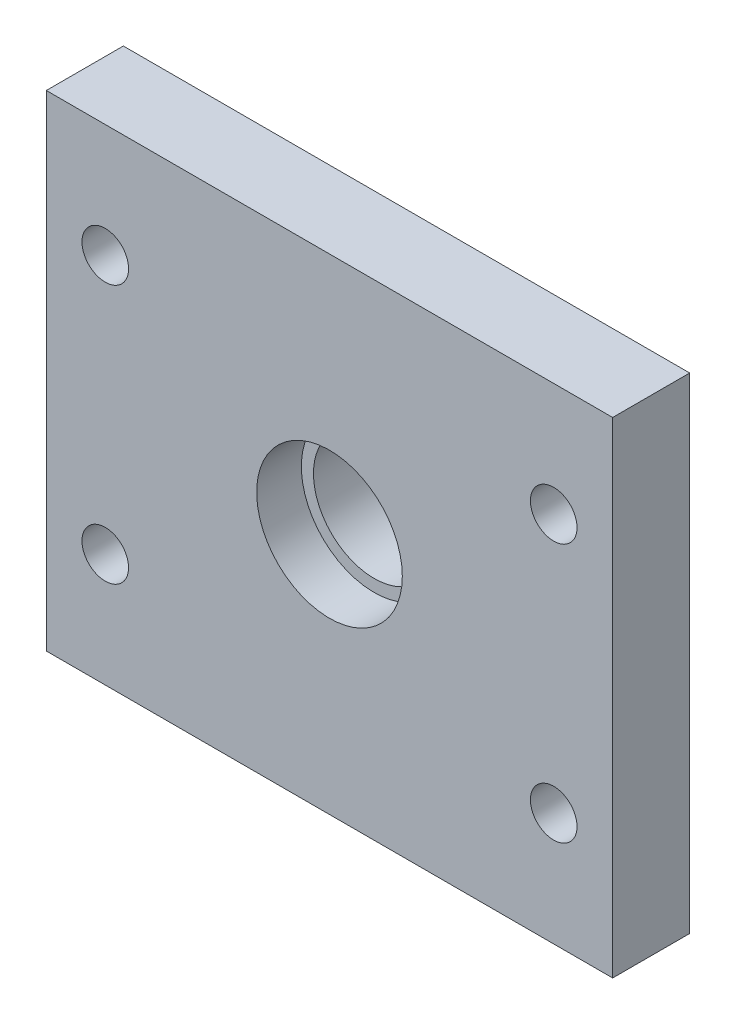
from build123d import *

# Parameters (mm, degrees)
SKETCH1_W          = 44.45
SKETCH1_H          = 38.1
EXTRUDE1_DEPTH     = 6.0452
SKETCH6_R          = 1.8288
CUT_EXTRUDE3_DEPTH = 59.855390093
SKETCH7_R          = 1.8288
CUT_EXTRUDE4_DEPTH = 59.855390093
SKETCH8_W          = 12.7
SKETCH8_H          = 12.7
EXTRUDE2_DEPTH     = 9.525
SKETCH5_R          = 2.3495
CUT_EXTRUDE2_DEPTH = 61.579234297
SKETCH9_R          = 4.7625
CUT_EXTRUDE5_DEPTH = 10.16
SKETCH10_R         = 5.715
CUT_EXTRUDE7_DEPTH = 3.5052


with BuildPart() as part:
    # Sketch1 → Extrude1 (new body)
    with BuildSketch(Plane.XY):
        with Locations((22.225, 19.05)):
            Rectangle(SKETCH1_W, SKETCH1_H)
    extrude(amount=EXTRUDE1_DEPTH)

    # Sketch6 → Cut-Extrude3 (cut, through all)
    with BuildSketch(Plane.XY.offset(6.0452)):
        with Locations((4.627363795, 8.89)):
            Circle(SKETCH6_R)
    extrude(amount=-CUT_EXTRUDE3_DEPTH, mode=Mode.SUBTRACT)

    # Sketch7 → Cut-Extrude4 (cut, through all)
    with BuildSketch(Plane.XY.offset(6.0452)):
        with Locations((4.627363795, 29.21)):
            Circle(SKETCH7_R)
        with Locations((39.822636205, 29.21)):
            Circle(SKETCH7_R)
        with Locations((39.822636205, 8.89)):
            Circle(SKETCH7_R)
    extrude(amount=-CUT_EXTRUDE4_DEPTH, mode=Mode.SUBTRACT)

    # Sketch8 → Extrude2 (add)
    with BuildSketch(Plane(origin=(0, 0, 0), x_dir=(-1, 0, 0), z_dir=(0, 0, -1))):
        with Locations((-22.225, 19.05)):
            Rectangle(SKETCH8_W, SKETCH8_H)
    extrude(amount=EXTRUDE2_DEPTH)

    # Sketch5 → Cut-Extrude2 (cut, through all)
    with BuildSketch(Plane.XY.offset(6.0452)):
        with Locations((22.225, 19.05)):
            Circle(SKETCH5_R)
    extrude(amount=-CUT_EXTRUDE2_DEPTH, mode=Mode.SUBTRACT)

    # Sketch9 → Cut-Extrude5 (cut)
    with BuildSketch(Plane.XY.offset(6.0452)):
        with Locations((22.225, 19.05)):
            Circle(SKETCH9_R)
    extrude(amount=-CUT_EXTRUDE5_DEPTH, mode=Mode.SUBTRACT)

    # Sketch10 → Cut-Extrude7 (cut)
    with BuildSketch(Plane.XY.offset(6.0452)):
        with Locations((22.225, 19.05)):
            Circle(SKETCH10_R)
    extrude(amount=-CUT_EXTRUDE7_DEPTH, mode=Mode.SUBTRACT)


solid = part.part
